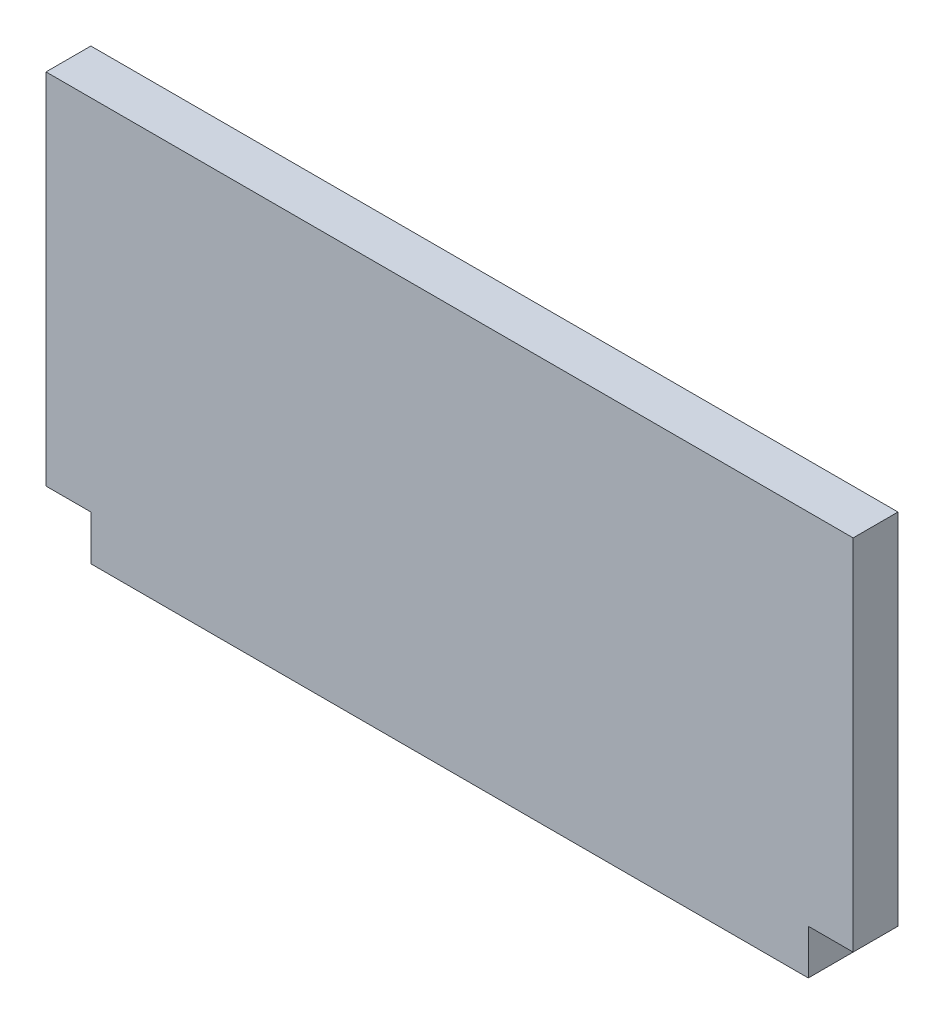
ISO-10303-21;
HEADER;
FILE_DESCRIPTION(('STEP AP214'),'2;1');
FILE_NAME('part.step','',(''),(''),'','','');
FILE_SCHEMA(('AUTOMOTIVE_DESIGN { 1 0 10303 214 1 1 1 1 }'));
ENDSEC;
DATA;
#1=APPLICATION_CONTEXT('core data for automotive mechanical design processes');
#2=APPLICATION_PROTOCOL_DEFINITION('international standard','automotive_design',2000,#1);
#3=PRODUCT_CONTEXT('',#1,'mechanical');
#4=PRODUCT('Part','Part','',(#3));
#5=PRODUCT_RELATED_PRODUCT_CATEGORY('part','',(#4));
#6=PRODUCT_DEFINITION_FORMATION('','',#4);
#7=PRODUCT_DEFINITION_CONTEXT('part definition',#1,'design');
#8=PRODUCT_DEFINITION('design','',#6,#7);
#9=PRODUCT_DEFINITION_SHAPE('','',#8);
#10=(LENGTH_UNIT() NAMED_UNIT(*) SI_UNIT(.MILLI.,.METRE.));
#11=(NAMED_UNIT(*) PLANE_ANGLE_UNIT() SI_UNIT($,.RADIAN.));
#12=(NAMED_UNIT(*) SI_UNIT($,.STERADIAN.) SOLID_ANGLE_UNIT());
#13=UNCERTAINTY_MEASURE_WITH_UNIT(LENGTH_MEASURE(1.E-05),#10,'distance_accuracy_value','');
#14=(GEOMETRIC_REPRESENTATION_CONTEXT(3) GLOBAL_UNCERTAINTY_ASSIGNED_CONTEXT((#13)) GLOBAL_UNIT_ASSIGNED_CONTEXT((#10,
#11,#12)) REPRESENTATION_CONTEXT('',''));
#15=CARTESIAN_POINT('',(0.,0.,0.));
#16=DIRECTION('',(0.,0.,1.));
#17=DIRECTION('',(1.,0.,0.));
#18=AXIS2_PLACEMENT_3D('',#15,#16,#17);
#19=CARTESIAN_POINT('',(-50.8,-25.4,6.35));
#20=DIRECTION('',(1.,0.,0.));
#21=DIRECTION('',(0.,1.,0.));
#22=AXIS2_PLACEMENT_3D('',#19,#20,#21);
#23=PLANE('',#22);
#24=DIRECTION('',(0.,-1.,0.));
#25=VECTOR('',#24,1.);
#26=CARTESIAN_POINT('',(-50.8,-25.4,0.));
#27=LINE('',#26,#25);
#28=CARTESIAN_POINT('',(-50.8,-25.4,0.));
#29=VERTEX_POINT('',#28);
#30=CARTESIAN_POINT('',(-50.8,-31.75,0.));
#31=VERTEX_POINT('',#30);
#32=EDGE_CURVE('E129',#29,#31,#27,.T.);
#33=ORIENTED_EDGE('',*,*,#32,.T.);
#34=DIRECTION('',(0.,0.,-1.));
#35=VECTOR('',#34,1.);
#36=CARTESIAN_POINT('',(-50.8,-31.75,6.35));
#37=LINE('',#36,#35);
#38=CARTESIAN_POINT('',(-50.8,-31.75,6.35));
#39=VERTEX_POINT('',#38);
#40=EDGE_CURVE('E11',#39,#31,#37,.T.);
#41=ORIENTED_EDGE('',*,*,#40,.F.);
#42=DIRECTION('',(0.,-1.,0.));
#43=VECTOR('',#42,1.);
#44=CARTESIAN_POINT('',(-50.8,-25.4,6.35));
#45=LINE('',#44,#43);
#46=CARTESIAN_POINT('',(-50.8,-25.4,6.35));
#47=VERTEX_POINT('',#46);
#48=EDGE_CURVE('E143',#47,#39,#45,.T.);
#49=ORIENTED_EDGE('',*,*,#48,.F.);
#50=DIRECTION('',(0.,0.,-1.));
#51=VECTOR('',#50,1.);
#52=CARTESIAN_POINT('',(-50.8,-25.4,6.35));
#53=LINE('',#52,#51);
#54=EDGE_CURVE('E125',#47,#29,#53,.T.);
#55=ORIENTED_EDGE('',*,*,#54,.T.);
#56=EDGE_LOOP('',(#33,#41,#49,#55));
#57=FACE_BOUND('',#56,.T.);
#58=ADVANCED_FACE('F33',(#57),#23,.F.);
#59=CARTESIAN_POINT('',(-50.8,-31.75,6.35));
#60=DIRECTION('',(0.,1.,0.));
#61=DIRECTION('',(-1.,0.,0.));
#62=AXIS2_PLACEMENT_3D('',#59,#60,#61);
#63=PLANE('',#62);
#64=DIRECTION('',(1.,0.,0.));
#65=VECTOR('',#64,1.);
#66=CARTESIAN_POINT('',(-50.8,-31.75,0.));
#67=LINE('',#66,#65);
#68=CARTESIAN_POINT('',(50.8,-31.75,0.));
#69=VERTEX_POINT('',#68);
#70=EDGE_CURVE('E132',#31,#69,#67,.T.);
#71=ORIENTED_EDGE('',*,*,#70,.T.);
#72=DIRECTION('',(0.,0.,-1.));
#73=VECTOR('',#72,1.);
#74=CARTESIAN_POINT('',(50.8,-31.75,6.35));
#75=LINE('',#74,#73);
#76=CARTESIAN_POINT('',(50.8,-31.75,6.35));
#77=VERTEX_POINT('',#76);
#78=EDGE_CURVE('E41',#77,#69,#75,.T.);
#79=ORIENTED_EDGE('',*,*,#78,.F.);
#80=DIRECTION('',(1.,0.,0.));
#81=VECTOR('',#80,1.);
#82=CARTESIAN_POINT('',(-50.8,-31.75,6.35));
#83=LINE('',#82,#81);
#84=EDGE_CURVE('E92',#39,#77,#83,.T.);
#85=ORIENTED_EDGE('',*,*,#84,.F.);
#86=ORIENTED_EDGE('',*,*,#40,.T.);
#87=EDGE_LOOP('',(#71,#79,#85,#86));
#88=FACE_BOUND('',#87,.T.);
#89=ADVANCED_FACE('F178',(#88),#63,.F.);
#90=CARTESIAN_POINT('',(50.8,-25.4,6.35));
#91=DIRECTION('',(-1.,0.,0.));
#92=DIRECTION('',(0.,-1.,0.));
#93=AXIS2_PLACEMENT_3D('',#90,#91,#92);
#94=PLANE('',#93);
#95=DIRECTION('',(0.,1.,0.));
#96=VECTOR('',#95,1.);
#97=CARTESIAN_POINT('',(50.8,-25.4,0.));
#98=LINE('',#97,#96);
#99=CARTESIAN_POINT('',(50.8,-25.4,0.));
#100=VERTEX_POINT('',#99);
#101=EDGE_CURVE('E134',#69,#100,#98,.T.);
#102=ORIENTED_EDGE('',*,*,#101,.T.);
#103=DIRECTION('',(0.,0.,-1.));
#104=VECTOR('',#103,1.);
#105=CARTESIAN_POINT('',(50.8,-25.4,6.35));
#106=LINE('',#105,#104);
#107=CARTESIAN_POINT('',(50.8,-25.4,6.35));
#108=VERTEX_POINT('',#107);
#109=EDGE_CURVE('E150',#108,#100,#106,.T.);
#110=ORIENTED_EDGE('',*,*,#109,.F.);
#111=DIRECTION('',(0.,1.,0.));
#112=VECTOR('',#111,1.);
#113=CARTESIAN_POINT('',(50.8,-25.4,6.35));
#114=LINE('',#113,#112);
#115=EDGE_CURVE('E158',#77,#108,#114,.T.);
#116=ORIENTED_EDGE('',*,*,#115,.F.);
#117=ORIENTED_EDGE('',*,*,#78,.T.);
#118=EDGE_LOOP('',(#102,#110,#116,#117));
#119=FACE_BOUND('',#118,.T.);
#120=ADVANCED_FACE('F156',(#119),#94,.F.);
#121=CARTESIAN_POINT('',(50.8,-25.4,6.35));
#122=DIRECTION('',(0.,1.,0.));
#123=DIRECTION('',(-1.,0.,0.));
#124=AXIS2_PLACEMENT_3D('',#121,#122,#123);
#125=PLANE('',#124);
#126=DIRECTION('',(1.,0.,0.));
#127=VECTOR('',#126,1.);
#128=CARTESIAN_POINT('',(50.8,-25.4,0.));
#129=LINE('',#128,#127);
#130=CARTESIAN_POINT('',(57.15,-25.4,0.));
#131=VERTEX_POINT('',#130);
#132=EDGE_CURVE('E136',#100,#131,#129,.T.);
#133=ORIENTED_EDGE('',*,*,#132,.T.);
#134=DIRECTION('',(0.,0.,-1.));
#135=VECTOR('',#134,1.);
#136=CARTESIAN_POINT('',(57.15,-25.4,6.35));
#137=LINE('',#136,#135);
#138=CARTESIAN_POINT('',(57.15,-25.4,6.35));
#139=VERTEX_POINT('',#138);
#140=EDGE_CURVE('E147',#139,#131,#137,.T.);
#141=ORIENTED_EDGE('',*,*,#140,.F.);
#142=DIRECTION('',(1.,0.,0.));
#143=VECTOR('',#142,1.);
#144=CARTESIAN_POINT('',(50.8,-25.4,6.35));
#145=LINE('',#144,#143);
#146=EDGE_CURVE('E170',#108,#139,#145,.T.);
#147=ORIENTED_EDGE('',*,*,#146,.F.);
#148=ORIENTED_EDGE('',*,*,#109,.T.);
#149=EDGE_LOOP('',(#133,#141,#147,#148));
#150=FACE_BOUND('',#149,.T.);
#151=ADVANCED_FACE('F166',(#150),#125,.F.);
#152=CARTESIAN_POINT('',(57.15,-25.4,6.35));
#153=DIRECTION('',(-1.,0.,0.));
#154=DIRECTION('',(0.,0.,1.));
#155=AXIS2_PLACEMENT_3D('',#152,#153,#154);
#156=PLANE('',#155);
#157=DIRECTION('',(0.,1.,0.));
#158=VECTOR('',#157,1.);
#159=CARTESIAN_POINT('',(57.15,-25.4,0.));
#160=LINE('',#159,#158);
#161=CARTESIAN_POINT('',(57.15,25.4,0.));
#162=VERTEX_POINT('',#161);
#163=EDGE_CURVE('E138',#131,#162,#160,.T.);
#164=ORIENTED_EDGE('',*,*,#163,.T.);
#165=DIRECTION('',(0.,0.,-1.));
#166=VECTOR('',#165,1.);
#167=CARTESIAN_POINT('',(57.15,25.4,6.35));
#168=LINE('',#167,#166);
#169=CARTESIAN_POINT('',(57.15,25.4,6.35));
#170=VERTEX_POINT('',#169);
#171=EDGE_CURVE('E120',#170,#162,#168,.T.);
#172=ORIENTED_EDGE('',*,*,#171,.F.);
#173=DIRECTION('',(0.,1.,0.));
#174=VECTOR('',#173,1.);
#175=CARTESIAN_POINT('',(57.15,-25.4,6.35));
#176=LINE('',#175,#174);
#177=EDGE_CURVE('E111',#139,#170,#176,.T.);
#178=ORIENTED_EDGE('',*,*,#177,.F.);
#179=ORIENTED_EDGE('',*,*,#140,.T.);
#180=EDGE_LOOP('',(#164,#172,#178,#179));
#181=FACE_BOUND('',#180,.T.);
#182=ADVANCED_FACE('F169',(#181),#156,.F.);
#183=CARTESIAN_POINT('',(-57.15,25.4,6.35));
#184=DIRECTION('',(0.,-1.,0.));
#185=DIRECTION('',(1.,0.,0.));
#186=AXIS2_PLACEMENT_3D('',#183,#184,#185);
#187=PLANE('',#186);
#188=DIRECTION('',(-1.,0.,0.));
#189=VECTOR('',#188,1.);
#190=CARTESIAN_POINT('',(-57.15,25.4,0.));
#191=LINE('',#190,#189);
#192=CARTESIAN_POINT('',(-57.15,25.4,0.));
#193=VERTEX_POINT('',#192);
#194=EDGE_CURVE('E119',#162,#193,#191,.T.);
#195=ORIENTED_EDGE('',*,*,#194,.T.);
#196=DIRECTION('',(0.,0.,-1.));
#197=VECTOR('',#196,1.);
#198=CARTESIAN_POINT('',(-57.15,25.4,6.35));
#199=LINE('',#198,#197);
#200=CARTESIAN_POINT('',(-57.15,25.4,6.35));
#201=VERTEX_POINT('',#200);
#202=EDGE_CURVE('E116',#201,#193,#199,.T.);
#203=ORIENTED_EDGE('',*,*,#202,.F.);
#204=DIRECTION('',(-1.,0.,0.));
#205=VECTOR('',#204,1.);
#206=CARTESIAN_POINT('',(-57.15,25.4,6.35));
#207=LINE('',#206,#205);
#208=EDGE_CURVE('E105',#170,#201,#207,.T.);
#209=ORIENTED_EDGE('',*,*,#208,.F.);
#210=ORIENTED_EDGE('',*,*,#171,.T.);
#211=EDGE_LOOP('',(#195,#203,#209,#210));
#212=FACE_BOUND('',#211,.T.);
#213=ADVANCED_FACE('F117',(#212),#187,.F.);
#214=CARTESIAN_POINT('',(-57.15,-25.4,6.35));
#215=DIRECTION('',(1.,0.,0.));
#216=DIRECTION('',(0.,0.,-1.));
#217=AXIS2_PLACEMENT_3D('',#214,#215,#216);
#218=PLANE('',#217);
#219=DIRECTION('',(0.,-1.,0.));
#220=VECTOR('',#219,1.);
#221=CARTESIAN_POINT('',(-57.15,-25.4,0.));
#222=LINE('',#221,#220);
#223=CARTESIAN_POINT('',(-57.15,-25.4,0.));
#224=VERTEX_POINT('',#223);
#225=EDGE_CURVE('E78',#193,#224,#222,.T.);
#226=ORIENTED_EDGE('',*,*,#225,.T.);
#227=DIRECTION('',(0.,0.,-1.));
#228=VECTOR('',#227,1.);
#229=CARTESIAN_POINT('',(-57.15,-25.4,6.35));
#230=LINE('',#229,#228);
#231=CARTESIAN_POINT('',(-57.15,-25.4,6.35));
#232=VERTEX_POINT('',#231);
#233=EDGE_CURVE('E121',#232,#224,#230,.T.);
#234=ORIENTED_EDGE('',*,*,#233,.F.);
#235=DIRECTION('',(0.,-1.,0.));
#236=VECTOR('',#235,1.);
#237=CARTESIAN_POINT('',(-57.15,-25.4,6.35));
#238=LINE('',#237,#236);
#239=EDGE_CURVE('E109',#201,#232,#238,.T.);
#240=ORIENTED_EDGE('',*,*,#239,.F.);
#241=ORIENTED_EDGE('',*,*,#202,.T.);
#242=EDGE_LOOP('',(#226,#234,#240,#241));
#243=FACE_BOUND('',#242,.T.);
#244=ADVANCED_FACE('F123',(#243),#218,.F.);
#245=CARTESIAN_POINT('',(-57.15,-25.4,6.35));
#246=DIRECTION('',(0.,1.,0.));
#247=DIRECTION('',(0.,0.,1.));
#248=AXIS2_PLACEMENT_3D('',#245,#246,#247);
#249=PLANE('',#248);
#250=DIRECTION('',(1.,0.,0.));
#251=VECTOR('',#250,1.);
#252=CARTESIAN_POINT('',(-57.15,-25.4,0.));
#253=LINE('',#252,#251);
#254=EDGE_CURVE('E84',#224,#29,#253,.T.);
#255=ORIENTED_EDGE('',*,*,#254,.T.);
#256=ORIENTED_EDGE('',*,*,#54,.F.);
#257=DIRECTION('',(1.,0.,0.));
#258=VECTOR('',#257,1.);
#259=CARTESIAN_POINT('',(-57.15,-25.4,6.35));
#260=LINE('',#259,#258);
#261=EDGE_CURVE('E49',#232,#47,#260,.T.);
#262=ORIENTED_EDGE('',*,*,#261,.F.);
#263=ORIENTED_EDGE('',*,*,#233,.T.);
#264=EDGE_LOOP('',(#255,#256,#262,#263));
#265=FACE_BOUND('',#264,.T.);
#266=ADVANCED_FACE('F194',(#265),#249,.F.);
#267=CARTESIAN_POINT('',(0.,0.,6.35));
#268=DIRECTION('',(0.,0.,1.));
#269=DIRECTION('',(1.,0.,0.));
#270=AXIS2_PLACEMENT_3D('',#267,#268,#269);
#271=PLANE('',#270);
#272=ORIENTED_EDGE('',*,*,#48,.T.);
#273=ORIENTED_EDGE('',*,*,#84,.T.);
#274=ORIENTED_EDGE('',*,*,#115,.T.);
#275=ORIENTED_EDGE('',*,*,#146,.T.);
#276=ORIENTED_EDGE('',*,*,#177,.T.);
#277=ORIENTED_EDGE('',*,*,#208,.T.);
#278=ORIENTED_EDGE('',*,*,#239,.T.);
#279=ORIENTED_EDGE('',*,*,#261,.T.);
#280=EDGE_LOOP('',(#272,#273,#274,#275,#276,#277,#278,#279));
#281=FACE_BOUND('',#280,.T.);
#282=ADVANCED_FACE('F107',(#281),#271,.T.);
#283=CARTESIAN_POINT('',(0.,0.,0.));
#284=DIRECTION('',(0.,0.,1.));
#285=DIRECTION('',(1.,0.,0.));
#286=AXIS2_PLACEMENT_3D('',#283,#284,#285);
#287=PLANE('',#286);
#288=ORIENTED_EDGE('',*,*,#32,.F.);
#289=ORIENTED_EDGE('',*,*,#254,.F.);
#290=ORIENTED_EDGE('',*,*,#225,.F.);
#291=ORIENTED_EDGE('',*,*,#194,.F.);
#292=ORIENTED_EDGE('',*,*,#163,.F.);
#293=ORIENTED_EDGE('',*,*,#132,.F.);
#294=ORIENTED_EDGE('',*,*,#101,.F.);
#295=ORIENTED_EDGE('',*,*,#70,.F.);
#296=EDGE_LOOP('',(#288,#289,#290,#291,#292,#293,#294,#295));
#297=FACE_BOUND('',#296,.T.);
#298=ADVANCED_FACE('F162',(#297),#287,.F.);
#299=CLOSED_SHELL('',(#58,#89,#120,#151,#182,#213,#244,#266,#282,#298));
#300=MANIFOLD_SOLID_BREP('B2',#299);
#301=ADVANCED_BREP_SHAPE_REPRESENTATION('',(#18,#300),#14);
#302=SHAPE_DEFINITION_REPRESENTATION(#9,#301);
ENDSEC;
END-ISO-10303-21;
